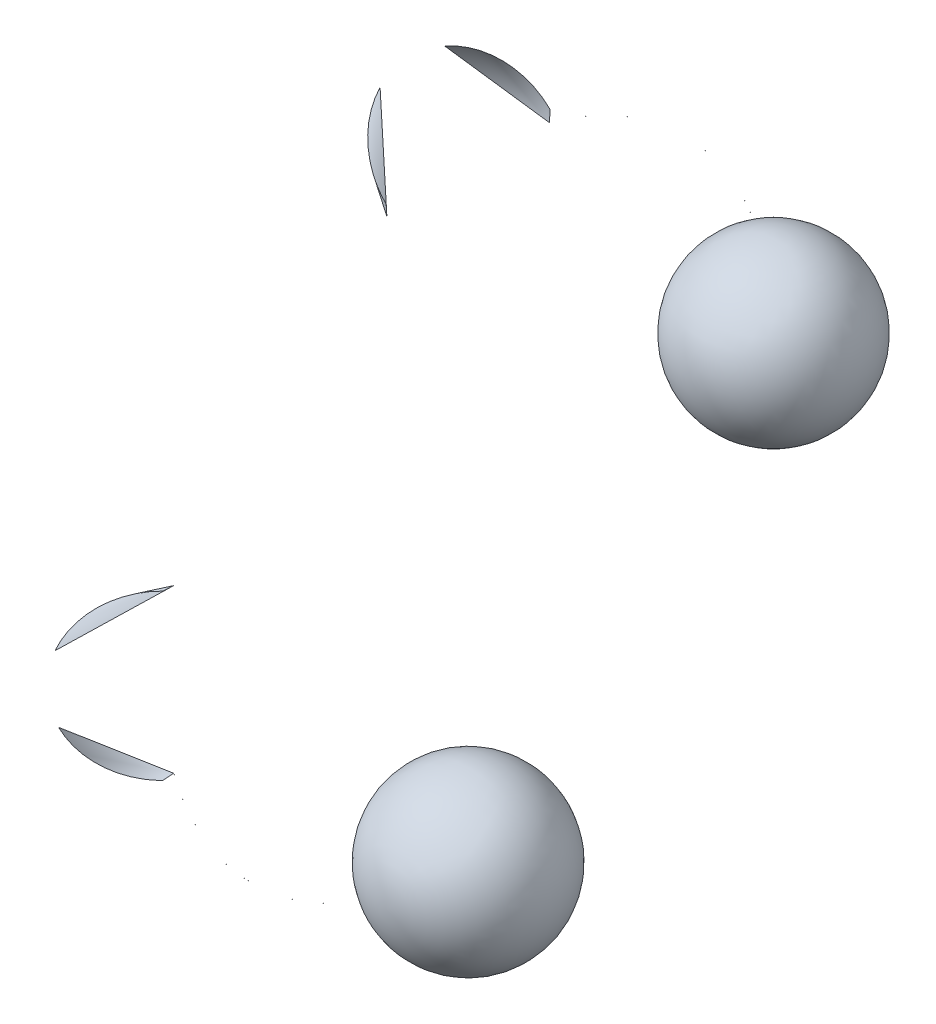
ISO-10303-21;
HEADER;
FILE_DESCRIPTION(('STEP AP214'),'2;1');
FILE_NAME('part.step','',(''),(''),'','','');
FILE_SCHEMA(('AUTOMOTIVE_DESIGN { 1 0 10303 214 1 1 1 1 }'));
ENDSEC;
DATA;
#1=APPLICATION_CONTEXT('core data for automotive mechanical design processes');
#2=APPLICATION_PROTOCOL_DEFINITION('international standard','automotive_design',2000,#1);
#3=PRODUCT_CONTEXT('',#1,'mechanical');
#4=PRODUCT('Part','Part','',(#3));
#5=PRODUCT_RELATED_PRODUCT_CATEGORY('part','',(#4));
#6=PRODUCT_DEFINITION_FORMATION('','',#4);
#7=PRODUCT_DEFINITION_CONTEXT('part definition',#1,'design');
#8=PRODUCT_DEFINITION('design','',#6,#7);
#9=PRODUCT_DEFINITION_SHAPE('','',#8);
#10=(LENGTH_UNIT() NAMED_UNIT(*) SI_UNIT(.MILLI.,.METRE.));
#11=(NAMED_UNIT(*) PLANE_ANGLE_UNIT() SI_UNIT($,.RADIAN.));
#12=(NAMED_UNIT(*) SI_UNIT($,.STERADIAN.) SOLID_ANGLE_UNIT());
#13=UNCERTAINTY_MEASURE_WITH_UNIT(LENGTH_MEASURE(1.E-05),#10,'distance_accuracy_value','');
#14=(GEOMETRIC_REPRESENTATION_CONTEXT(3) GLOBAL_UNCERTAINTY_ASSIGNED_CONTEXT((#13)) GLOBAL_UNIT_ASSIGNED_CONTEXT((#10,
#11,#12)) REPRESENTATION_CONTEXT('',''));
#15=CARTESIAN_POINT('',(0.,0.,0.));
#16=DIRECTION('',(0.,0.,1.));
#17=DIRECTION('',(1.,0.,0.));
#18=AXIS2_PLACEMENT_3D('',#15,#16,#17);
#19=CARTESIAN_POINT('',(6.,0.,0.));
#20=DIRECTION('',(1.,0.,0.));
#21=DIRECTION('',(0.,-1.,0.));
#22=AXIS2_PLACEMENT_3D('',#19,#20,#21);
#23=TOROIDAL_SURFACE('',#22,14.275,0.0001);
#24=CARTESIAN_POINT('',(5.99996532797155,-3.79863575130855,-13.7604022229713));
#25=CARTESIAN_POINT('',(5.99996006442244,-3.79863548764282,-13.7604002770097));
#26=CARTESIAN_POINT('',(5.99995496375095,-3.79863516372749,-13.7603978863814));
#27=CARTESIAN_POINT('',(5.99994523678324,-3.79863440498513,-13.7603922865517));
#28=CARTESIAN_POINT('',(5.99994061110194,-3.79863397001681,-13.7603890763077));
#29=CARTESIAN_POINT('',(5.99993197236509,-3.79863300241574,-13.7603819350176));
#30=CARTESIAN_POINT('',(5.99992795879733,-3.79863246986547,-13.7603780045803));
#31=CARTESIAN_POINT('',(5.99992064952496,-3.79863132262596,-13.760369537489));
#32=CARTESIAN_POINT('',(5.9999173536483,-3.79863070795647,-13.7603650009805));
#33=CARTESIAN_POINT('',(5.99991154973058,-3.79862940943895,-13.7603554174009));
#34=CARTESIAN_POINT('',(5.99990904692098,-3.79862872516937,-13.7603503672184));
#35=CARTESIAN_POINT('',(5.99990492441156,-3.79862731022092,-13.7603399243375));
#36=CARTESIAN_POINT('',(5.99990330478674,-3.79862657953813,-13.7603345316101));
#37=CARTESIAN_POINT('',(5.99990098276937,-3.79862508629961,-13.7603235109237));
#38=CARTESIAN_POINT('',(5.99990028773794,-3.79862432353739,-13.7603178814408));
#39=CARTESIAN_POINT('',(5.99989985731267,-3.79862279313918,-13.7603065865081));
#40=CARTESIAN_POINT('',(5.99990012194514,-3.79862202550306,-13.7603009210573));
#41=CARTESIAN_POINT('',(5.99990160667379,-3.79862050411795,-13.7602896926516));
#42=CARTESIAN_POINT('',(5.99990283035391,-3.79861975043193,-13.7602841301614));
#43=CARTESIAN_POINT('',(5.99990620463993,-3.79861828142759,-13.7602732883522));
#44=CARTESIAN_POINT('',(5.99990835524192,-3.79861756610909,-13.760268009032));
#45=CARTESIAN_POINT('',(5.99991351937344,-3.79861619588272,-13.7602578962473));
#46=CARTESIAN_POINT('',(5.9999165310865,-3.79861554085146,-13.7602530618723));
#47=CARTESIAN_POINT('',(5.99992333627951,-3.79861430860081,-13.7602439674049));
#48=CARTESIAN_POINT('',(5.99992712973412,-3.79861373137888,-13.7602397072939));
#49=CARTESIAN_POINT('',(5.99993536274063,-3.79861267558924,-13.7602319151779));
#50=CARTESIAN_POINT('',(5.99993979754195,-3.79861219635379,-13.7602283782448));
#51=CARTESIAN_POINT('',(5.99994920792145,-3.79861134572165,-13.7602221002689));
#52=CARTESIAN_POINT('',(5.9999541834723,-3.7986109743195,-13.760219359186));
#53=CARTESIAN_POINT('',(5.99996448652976,-3.79861035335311,-13.7602147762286));
#54=CARTESIAN_POINT('',(5.99996981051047,-3.7986101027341,-13.7602129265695));
#55=CARTESIAN_POINT('',(5.9999806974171,-3.79860972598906,-13.7602101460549));
#56=CARTESIAN_POINT('',(5.99998626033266,-3.79860959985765,-13.7602092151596));
#57=CARTESIAN_POINT('',(5.99999742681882,-3.79860947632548,-13.7602083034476));
#58=CARTESIAN_POINT('',(6.00000302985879,-3.79860947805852,-13.760208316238));
#59=CARTESIAN_POINT('',(6.00001415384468,-3.79860960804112,-13.7602092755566));
#60=CARTESIAN_POINT('',(6.00001967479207,-3.79860973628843,-13.760210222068));
#61=CARTESIAN_POINT('',(6.00003046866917,-3.79861011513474,-13.7602130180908));
#62=CARTESIAN_POINT('',(6.00003574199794,-3.79861036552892,-13.7602148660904));
#63=CARTESIAN_POINT('',(6.00004590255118,-3.79861098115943,-13.7602194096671));
#64=CARTESIAN_POINT('',(6.00005078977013,-3.7986113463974,-13.7602221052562));
#65=CARTESIAN_POINT('',(6.00006006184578,-3.79861218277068,-13.7602282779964));
#66=CARTESIAN_POINT('',(6.00006444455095,-3.79861265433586,-13.7602317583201));
#67=CARTESIAN_POINT('',(6.00007256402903,-3.79861368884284,-13.7602393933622));
#68=CARTESIAN_POINT('',(6.00007630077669,-3.79861425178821,-13.760243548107));
#69=CARTESIAN_POINT('',(6.00008305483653,-3.79861545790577,-13.7602524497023));
#70=CARTESIAN_POINT('',(6.00008606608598,-3.79861610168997,-13.7602572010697));
#71=CARTESIAN_POINT('',(6.00009124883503,-3.79861744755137,-13.7602671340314));
#72=CARTESIAN_POINT('',(6.00009342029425,-3.79861814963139,-13.7602723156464));
#73=CARTESIAN_POINT('',(6.00009688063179,-3.7986195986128,-13.7602830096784));
#74=CARTESIAN_POINT('',(6.00009816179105,-3.79862034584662,-13.7602885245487));
#75=CARTESIAN_POINT('',(6.00009977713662,-3.79862185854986,-13.7602996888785));
#76=CARTESIAN_POINT('',(6.00010011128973,-3.79862262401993,-13.7603053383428));
#77=CARTESIAN_POINT('',(6.00009982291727,-3.79862415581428,-13.760316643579));
#78=CARTESIAN_POINT('',(6.0000991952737,-3.79862492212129,-13.7603222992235));
#79=CARTESIAN_POINT('',(6.00009699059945,-3.79862642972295,-13.7603334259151));
#80=CARTESIAN_POINT('',(6.00009541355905,-3.79862717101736,-13.7603388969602));
#81=CARTESIAN_POINT('',(6.00009135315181,-3.79862860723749,-13.7603494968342));
#82=CARTESIAN_POINT('',(6.00008887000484,-3.79862930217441,-13.7603546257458));
#83=CARTESIAN_POINT('',(6.00008306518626,-3.79863062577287,-13.7603643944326));
#84=CARTESIAN_POINT('',(6.00007974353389,-3.79863125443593,-13.760369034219));
#85=CARTESIAN_POINT('',(6.00007237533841,-3.79863242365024,-13.7603776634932));
#86=CARTESIAN_POINT('',(6.0000683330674,-3.79863296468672,-13.7603816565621));
#87=CARTESIAN_POINT('',(6.00005962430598,-3.79863394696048,-13.7603889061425));
#88=CARTESIAN_POINT('',(6.0000549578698,-3.7986343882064,-13.7603921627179));
#89=CARTESIAN_POINT('',(6.00004517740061,-3.7986351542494,-13.7603978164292));
#90=CARTESIAN_POINT('',(6.00004006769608,-3.79863548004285,-13.7604002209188));
#91=CARTESIAN_POINT('',(6.00002950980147,-3.79863601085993,-13.7604041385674));
#92=CARTESIAN_POINT('',(6.00002406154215,-3.79863621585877,-13.7604056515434));
#93=CARTESIAN_POINT('',(6.00001302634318,-3.79863649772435,-13.7604077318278));
#94=CARTESIAN_POINT('',(6.0000074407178,-3.79863657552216,-13.7604083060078));
#95=CARTESIAN_POINT('',(5.99999625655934,-3.79863660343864,-13.760408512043));
#96=CARTESIAN_POINT('',(5.99999065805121,-3.79863655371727,-13.7604081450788));
#97=CARTESIAN_POINT('',(5.99998175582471,-3.7986363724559,-13.7604068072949));
#98=CARTESIAN_POINT('',(5.99997840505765,-3.7986362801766,-13.7604061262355));
#99=CARTESIAN_POINT('',(5.99997179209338,-3.79863604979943,-13.760404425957));
#100=CARTESIAN_POINT('',(5.99996852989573,-3.79863591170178,-13.7604034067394));
#101=CARTESIAN_POINT('',(5.99996532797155,-3.79863575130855,-13.7604022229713));
#102=B_SPLINE_CURVE_WITH_KNOTS('',3,(#24,#25,#26,#27,#28,#29,#30,#31,#32,#33,#34,#35,#36,#37,
#38,#39,#40,#41,#42,#43,#44,#45,#46,#47,#48,#49,#50,#51,#52,#53,#54,#55,#56,#57,#58,#59,#60,#61,
#62,#63,#64,#65,#66,#67,#68,#69,#70,#71,#72,#73,#74,#75,#76,#77,#78,#79,#80,#81,#82,#83,#84,#85,
#86,#87,#88,#89,#90,#91,#92,#93,#94,#95,#96,#97,#98,#99,#100,#101),.UNSPECIFIED.,.T.,.F.,(4,2,2,
2,2,2,2,2,2,2,2,2,2,2,2,2,2,2,2,2,2,2,2,2,2,2,2,2,2,2,2,2,2,2,2,2,2,2,4),(0.,
1.68412306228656E-05,3.3703996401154E-05,5.05525733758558E-05,6.73971071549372E-05,
8.43505480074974E-05,0.000101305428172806,0.000118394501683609,0.000135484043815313,
0.000152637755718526,0.000169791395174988,0.00018690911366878,0.000204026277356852,
0.000221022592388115,0.000238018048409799,0.000254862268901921,0.000271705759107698,
0.000288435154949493,0.000305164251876,0.000321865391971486,0.000338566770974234,
0.000355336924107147,0.000372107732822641,0.000389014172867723,0.000405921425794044,
0.00042297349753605,0.000440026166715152,0.000457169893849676,0.000474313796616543,
0.000491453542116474,0.000508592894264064,0.000525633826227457,0.000542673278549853,
0.000559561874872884,0.000576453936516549,0.00059322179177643,0.000609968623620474,
0.000620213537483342,0.000630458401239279),.UNSPECIFIED.);
#103=CARTESIAN_POINT('',(5.99996532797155,-3.79863575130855,-13.7604022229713));
#104=VERTEX_POINT('',#103);
#105=EDGE_CURVE('E10',#104,#104,#102,.T.);
#106=ORIENTED_EDGE('',*,*,#105,.F.);
#107=EDGE_LOOP('',(#106));
#108=FACE_BOUND('',#107,.T.);
#109=CARTESIAN_POINT('',(5.99996532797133,-13.7604022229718,-3.79863575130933));
#110=CARTESIAN_POINT('',(5.99997054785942,-13.7604041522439,-3.7986360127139));
#111=CARTESIAN_POINT('',(5.99997593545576,-13.7604056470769,-3.79863621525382));
#112=CARTESIAN_POINT('',(5.99998689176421,-13.7604077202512,-3.79863649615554));
#113=CARTESIAN_POINT('',(5.99999246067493,-13.7604082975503,-3.79863657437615));
#114=CARTESIAN_POINT('',(6.00000361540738,-13.7604085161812,-3.79863660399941));
#115=CARTESIAN_POINT('',(6.00000920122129,-13.7604081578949,-3.7986365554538));
#116=CARTESIAN_POINT('',(6.00002023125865,-13.7604065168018,-3.79863633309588));
#117=CARTESIAN_POINT('',(6.00002567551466,-13.7604052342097,-3.79863615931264));
#118=CARTESIAN_POINT('',(6.00003626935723,-13.760401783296,-3.79863569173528));
#119=CARTESIAN_POINT('',(6.00004141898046,-13.760399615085,-3.79863539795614));
#120=CARTESIAN_POINT('',(6.00005128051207,-13.7603944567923,-3.79863469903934));
#121=CARTESIAN_POINT('',(6.00005599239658,-13.7603914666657,-3.79863429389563));
#122=CARTESIAN_POINT('',(6.00006487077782,-13.7603847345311,-3.7986333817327));
#123=CARTESIAN_POINT('',(6.00006903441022,-13.7603809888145,-3.798632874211));
#124=CARTESIAN_POINT('',(6.00007667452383,-13.7603728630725,-3.79863177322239));
#125=CARTESIAN_POINT('',(6.00008015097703,-13.7603684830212,-3.79863117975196));
#126=CARTESIAN_POINT('',(6.00008634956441,-13.7603591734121,-3.79862991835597));
#127=CARTESIAN_POINT('',(6.00008906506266,-13.7603542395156,-3.79862924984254));
#128=CARTESIAN_POINT('',(6.00009362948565,-13.7603439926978,-3.79862786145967));
#129=CARTESIAN_POINT('',(6.00009547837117,-13.7603386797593,-3.79862714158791));
#130=CARTESIAN_POINT('',(6.00009827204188,-13.7603277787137,-3.79862566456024));
#131=CARTESIAN_POINT('',(6.00009920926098,-13.7603221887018,-3.79862490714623));
#132=CARTESIAN_POINT('',(6.00010012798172,-13.7603109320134,-3.79862338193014));
#133=CARTESIAN_POINT('',(6.00010010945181,-13.7603052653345,-3.79862261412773));
#134=CARTESIAN_POINT('',(6.00009911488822,-13.7602939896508,-3.79862108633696));
#135=CARTESIAN_POINT('',(6.00009813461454,-13.7602883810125,-3.79862032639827));
#136=CARTESIAN_POINT('',(6.00009523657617,-13.760277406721,-3.79861883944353));
#137=CARTESIAN_POINT('',(6.0000933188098,-13.760272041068,-3.79861811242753));
#138=CARTESIAN_POINT('',(6.00008860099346,-13.7602617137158,-3.79861671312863));
#139=CARTESIAN_POINT('',(6.00008580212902,-13.760256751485,-3.7986160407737));
#140=CARTESIAN_POINT('',(6.00007939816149,-13.7602473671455,-3.79861476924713));
#141=CARTESIAN_POINT('',(6.00007579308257,-13.7602429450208,-3.7986141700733));
#142=CARTESIAN_POINT('',(6.00006790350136,-13.7602347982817,-3.79861306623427));
#143=CARTESIAN_POINT('',(6.00006362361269,-13.7602310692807,-3.79861256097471));
#144=CARTESIAN_POINT('',(6.00005448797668,-13.7602243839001,-3.79861165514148));
#145=CARTESIAN_POINT('',(6.00004963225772,-13.7602214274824,-3.79861125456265));
#146=CARTESIAN_POINT('',(6.00003952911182,-13.7602163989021,-3.79861057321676));
#147=CARTESIAN_POINT('',(6.0000342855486,-13.7602143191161,-3.79861029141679));
#148=CARTESIAN_POINT('',(6.0000235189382,-13.7602110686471,-3.79860985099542));
#149=CARTESIAN_POINT('',(6.00001799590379,-13.7602098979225,-3.79860969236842));
#150=CARTESIAN_POINT('',(6.00000687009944,-13.760208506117,-3.79860950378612));
#151=CARTESIAN_POINT('',(6.00000126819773,-13.7602082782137,-3.79860947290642));
#152=CARTESIAN_POINT('',(5.99999010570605,-13.7602087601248,-3.79860953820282));
#153=CARTESIAN_POINT('',(5.99998454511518,-13.7602094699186,-3.79860963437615));
#154=CARTESIAN_POINT('',(5.99997363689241,-13.7602118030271,-3.79860995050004));
#155=CARTESIAN_POINT('',(5.9999682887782,-13.7602134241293,-3.79861017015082));
#156=CARTESIAN_POINT('',(5.99995794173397,-13.7602175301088,-3.79861072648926));
#157=CARTESIAN_POINT('',(5.9999529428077,-13.7602200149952,-3.79861106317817));
#158=CARTESIAN_POINT('',(5.99994341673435,-13.7602257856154,-3.79861184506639));
#159=CARTESIAN_POINT('',(5.99993889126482,-13.7602290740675,-3.79861229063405));
#160=CARTESIAN_POINT('',(5.99993045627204,-13.760236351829,-3.79861327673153));
#161=CARTESIAN_POINT('',(5.99992654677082,-13.7602403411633,-3.79861381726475));
#162=CARTESIAN_POINT('',(5.9999194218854,-13.7602489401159,-3.79861498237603));
#163=CARTESIAN_POINT('',(5.99991621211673,-13.7602535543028,-3.79861560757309));
#164=CARTESIAN_POINT('',(5.999910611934,-13.760263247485,-3.79861692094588));
#165=CARTESIAN_POINT('',(5.99990822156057,-13.7602683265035,-3.79861760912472));
#166=CARTESIAN_POINT('',(5.99990430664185,-13.7602788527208,-3.7986190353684));
#167=CARTESIAN_POINT('',(5.99990278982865,-13.7602843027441,-3.79861977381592));
#168=CARTESIAN_POINT('',(5.99990069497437,-13.760295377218,-3.79862127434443));
#169=CARTESIAN_POINT('',(5.99990011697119,-13.7603010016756,-3.79862203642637));
#170=CARTESIAN_POINT('',(5.99989991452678,-13.7603123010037,-3.79862356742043));
#171=CARTESIAN_POINT('',(5.99990029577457,-13.760317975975,-3.79862433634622));
#172=CARTESIAN_POINT('',(5.99990201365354,-13.7603291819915,-3.79862585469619));
#173=CARTESIAN_POINT('',(5.99990335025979,-13.7603347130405,-3.79862660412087));
#174=CARTESIAN_POINT('',(5.99990694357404,-13.7603454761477,-3.79862806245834));
#175=CARTESIAN_POINT('',(5.99990920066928,-13.7603507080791,-3.79862877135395));
#176=CARTESIAN_POINT('',(5.99991457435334,-13.7603607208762,-3.79863012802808));
#177=CARTESIAN_POINT('',(5.99991769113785,-13.7603655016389,-3.79863077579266));
#178=CARTESIAN_POINT('',(5.99992468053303,-13.7603744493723,-3.79863198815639));
#179=CARTESIAN_POINT('',(5.99992854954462,-13.7603786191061,-3.79863255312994));
#180=CARTESIAN_POINT('',(5.99993694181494,-13.7603862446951,-3.7986335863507));
#181=CARTESIAN_POINT('',(5.99994146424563,-13.7603897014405,-3.79863405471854));
#182=CARTESIAN_POINT('',(5.99994924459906,-13.7603946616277,-3.79863472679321));
#183=CARTESIAN_POINT('',(5.99995234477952,-13.7603964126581,-3.79863496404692));
#184=CARTESIAN_POINT('',(5.99995871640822,-13.7603995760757,-3.79863539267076));
#185=CARTESIAN_POINT('',(5.99996198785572,-13.7604009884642,-3.7986355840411));
#186=CARTESIAN_POINT('',(5.99996532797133,-13.7604022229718,-3.79863575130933));
#187=B_SPLINE_CURVE_WITH_KNOTS('',3,(#109,#110,#111,#112,#113,#114,#115,#116,#117,#118,#119,
#120,#121,#122,#123,#124,#125,#126,#127,#128,#129,#130,#131,#132,#133,#134,#135,#136,#137,#138,
#139,#140,#141,#142,#143,#144,#145,#146,#147,#148,#149,#150,#151,#152,#153,#154,#155,#156,#157,
#158,#159,#160,#161,#162,#163,#164,#165,#166,#167,#168,#169,#170,#171,#172,#173,#174,#175,#176,
#177,#178,#179,#180,#181,#182,#183,#184,#185,#186),.UNSPECIFIED.,.T.,.F.,(4,2,2,2,2,2,2,2,2,2,2,
2,2,2,2,2,2,2,2,2,2,2,2,2,2,2,2,2,2,2,2,2,2,2,2,2,2,2,4),(0.,1.6700465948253E-05,
3.34198844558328E-05,5.01324789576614E-05,6.68411947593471E-05,8.3547826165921E-05,
0.000100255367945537,0.000117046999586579,0.000133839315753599,0.000150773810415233,
0.000167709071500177,0.000184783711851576,0.000201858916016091,0.000219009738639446,
0.0002361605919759,0.000253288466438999,0.000270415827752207,0.000287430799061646,
0.000304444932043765,0.000321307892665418,0.000338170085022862,0.000354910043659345,
0.000371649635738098,0.000388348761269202,0.000405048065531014,0.000421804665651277,
0.000438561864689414,0.00045544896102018,0.00047233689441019,0.000489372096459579,
0.000506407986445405,0.000523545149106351,0.000540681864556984,0.000557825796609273,
0.000574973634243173,0.000592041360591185,0.000609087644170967,0.000619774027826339,
0.000630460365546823),.UNSPECIFIED.);
#188=CARTESIAN_POINT('',(5.99996532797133,-13.7604022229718,-3.79863575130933));
#189=VERTEX_POINT('',#188);
#190=EDGE_CURVE('E30',#189,#189,#187,.T.);
#191=ORIENTED_EDGE('',*,*,#190,.F.);
#192=EDGE_LOOP('',(#191));
#193=FACE_BOUND('',#192,.T.);
#194=ADVANCED_FACE('F14',(#108,#193),#23,.T.);
#195=CARTESIAN_POINT('',(5.99996532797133,3.79863575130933,-13.7604022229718));
#196=CARTESIAN_POINT('',(5.99997054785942,3.79863601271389,-13.7604041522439));
#197=CARTESIAN_POINT('',(5.99997593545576,3.79863621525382,-13.7604056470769));
#198=CARTESIAN_POINT('',(5.99998689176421,3.79863649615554,-13.7604077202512));
#199=CARTESIAN_POINT('',(5.99999246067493,3.79863657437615,-13.7604082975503));
#200=CARTESIAN_POINT('',(6.00000361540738,3.79863660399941,-13.7604085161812));
#201=CARTESIAN_POINT('',(6.00000920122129,3.7986365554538,-13.7604081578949));
#202=CARTESIAN_POINT('',(6.00002023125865,3.79863633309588,-13.7604065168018));
#203=CARTESIAN_POINT('',(6.00002567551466,3.79863615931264,-13.7604052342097));
#204=CARTESIAN_POINT('',(6.00003626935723,3.79863569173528,-13.760401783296));
#205=CARTESIAN_POINT('',(6.00004141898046,3.79863539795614,-13.760399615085));
#206=CARTESIAN_POINT('',(6.00005128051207,3.79863469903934,-13.7603944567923));
#207=CARTESIAN_POINT('',(6.00005599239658,3.79863429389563,-13.7603914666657));
#208=CARTESIAN_POINT('',(6.00006487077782,3.7986333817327,-13.7603847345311));
#209=CARTESIAN_POINT('',(6.00006903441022,3.798632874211,-13.7603809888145));
#210=CARTESIAN_POINT('',(6.00007667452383,3.79863177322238,-13.7603728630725));
#211=CARTESIAN_POINT('',(6.00008015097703,3.79863117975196,-13.7603684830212));
#212=CARTESIAN_POINT('',(6.00008634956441,3.79862991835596,-13.7603591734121));
#213=CARTESIAN_POINT('',(6.00008906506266,3.79862924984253,-13.7603542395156));
#214=CARTESIAN_POINT('',(6.00009362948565,3.79862786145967,-13.7603439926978));
#215=CARTESIAN_POINT('',(6.00009547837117,3.79862714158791,-13.7603386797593));
#216=CARTESIAN_POINT('',(6.00009827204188,3.79862566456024,-13.7603277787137));
#217=CARTESIAN_POINT('',(6.00009920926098,3.79862490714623,-13.7603221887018));
#218=CARTESIAN_POINT('',(6.00010012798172,3.79862338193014,-13.7603109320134));
#219=CARTESIAN_POINT('',(6.00010010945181,3.79862261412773,-13.7603052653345));
#220=CARTESIAN_POINT('',(6.00009911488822,3.79862108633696,-13.7602939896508));
#221=CARTESIAN_POINT('',(6.00009813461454,3.79862032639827,-13.7602883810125));
#222=CARTESIAN_POINT('',(6.00009523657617,3.79861883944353,-13.760277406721));
#223=CARTESIAN_POINT('',(6.0000933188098,3.79861811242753,-13.760272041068));
#224=CARTESIAN_POINT('',(6.00008860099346,3.79861671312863,-13.7602617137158));
#225=CARTESIAN_POINT('',(6.00008580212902,3.7986160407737,-13.760256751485));
#226=CARTESIAN_POINT('',(6.00007939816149,3.79861476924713,-13.7602473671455));
#227=CARTESIAN_POINT('',(6.00007579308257,3.7986141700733,-13.7602429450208));
#228=CARTESIAN_POINT('',(6.00006790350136,3.79861306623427,-13.7602347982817));
#229=CARTESIAN_POINT('',(6.00006362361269,3.79861256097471,-13.7602310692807));
#230=CARTESIAN_POINT('',(6.00005448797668,3.79861165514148,-13.7602243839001));
#231=CARTESIAN_POINT('',(6.00004963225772,3.79861125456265,-13.7602214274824));
#232=CARTESIAN_POINT('',(6.00003952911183,3.79861057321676,-13.760216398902));
#233=CARTESIAN_POINT('',(6.0000342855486,3.79861029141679,-13.7602143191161));
#234=CARTESIAN_POINT('',(6.00002351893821,3.79860985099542,-13.7602110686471));
#235=CARTESIAN_POINT('',(6.00001799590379,3.79860969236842,-13.7602098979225));
#236=CARTESIAN_POINT('',(6.00000687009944,3.79860950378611,-13.7602085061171));
#237=CARTESIAN_POINT('',(6.00000126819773,3.79860947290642,-13.7602082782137));
#238=CARTESIAN_POINT('',(5.99999010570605,3.79860953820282,-13.7602087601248));
#239=CARTESIAN_POINT('',(5.99998454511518,3.79860963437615,-13.7602094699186));
#240=CARTESIAN_POINT('',(5.99997363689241,3.79860995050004,-13.7602118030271));
#241=CARTESIAN_POINT('',(5.9999682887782,3.79861017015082,-13.7602134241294));
#242=CARTESIAN_POINT('',(5.99995794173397,3.79861072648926,-13.7602175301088));
#243=CARTESIAN_POINT('',(5.9999529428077,3.79861106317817,-13.7602200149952));
#244=CARTESIAN_POINT('',(5.99994341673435,3.79861184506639,-13.7602257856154));
#245=CARTESIAN_POINT('',(5.99993889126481,3.79861229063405,-13.7602290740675));
#246=CARTESIAN_POINT('',(5.99993045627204,3.79861327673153,-13.760236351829));
#247=CARTESIAN_POINT('',(5.99992654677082,3.79861381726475,-13.7602403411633));
#248=CARTESIAN_POINT('',(5.9999194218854,3.79861498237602,-13.7602489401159));
#249=CARTESIAN_POINT('',(5.99991621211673,3.79861560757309,-13.7602535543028));
#250=CARTESIAN_POINT('',(5.999910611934,3.79861692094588,-13.760263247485));
#251=CARTESIAN_POINT('',(5.99990822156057,3.79861760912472,-13.7602683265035));
#252=CARTESIAN_POINT('',(5.99990430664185,3.79861903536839,-13.7602788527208));
#253=CARTESIAN_POINT('',(5.99990278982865,3.79861977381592,-13.7602843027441));
#254=CARTESIAN_POINT('',(5.99990069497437,3.79862127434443,-13.760295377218));
#255=CARTESIAN_POINT('',(5.99990011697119,3.79862203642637,-13.7603010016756));
#256=CARTESIAN_POINT('',(5.99989991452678,3.79862356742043,-13.7603123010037));
#257=CARTESIAN_POINT('',(5.99990029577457,3.79862433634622,-13.760317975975));
#258=CARTESIAN_POINT('',(5.99990201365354,3.79862585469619,-13.7603291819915));
#259=CARTESIAN_POINT('',(5.99990335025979,3.79862660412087,-13.7603347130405));
#260=CARTESIAN_POINT('',(5.99990694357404,3.79862806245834,-13.7603454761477));
#261=CARTESIAN_POINT('',(5.99990920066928,3.79862877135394,-13.7603507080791));
#262=CARTESIAN_POINT('',(5.99991457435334,3.79863012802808,-13.7603607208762));
#263=CARTESIAN_POINT('',(5.99991769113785,3.79863077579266,-13.7603655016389));
#264=CARTESIAN_POINT('',(5.99992468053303,3.79863198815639,-13.7603744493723));
#265=CARTESIAN_POINT('',(5.99992854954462,3.79863255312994,-13.7603786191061));
#266=CARTESIAN_POINT('',(5.99993694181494,3.7986335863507,-13.7603862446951));
#267=CARTESIAN_POINT('',(5.99994146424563,3.79863405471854,-13.7603897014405));
#268=CARTESIAN_POINT('',(5.99994924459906,3.79863472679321,-13.7603946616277));
#269=CARTESIAN_POINT('',(5.99995234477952,3.79863496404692,-13.7603964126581));
#270=CARTESIAN_POINT('',(5.99995871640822,3.79863539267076,-13.7603995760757));
#271=CARTESIAN_POINT('',(5.99996198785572,3.7986355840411,-13.7604009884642));
#272=CARTESIAN_POINT('',(5.99996532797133,3.79863575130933,-13.7604022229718));
#273=B_SPLINE_CURVE_WITH_KNOTS('',3,(#195,#196,#197,#198,#199,#200,#201,#202,#203,#204,#205,
#206,#207,#208,#209,#210,#211,#212,#213,#214,#215,#216,#217,#218,#219,#220,#221,#222,#223,#224,
#225,#226,#227,#228,#229,#230,#231,#232,#233,#234,#235,#236,#237,#238,#239,#240,#241,#242,#243,
#244,#245,#246,#247,#248,#249,#250,#251,#252,#253,#254,#255,#256,#257,#258,#259,#260,#261,#262,
#263,#264,#265,#266,#267,#268,#269,#270,#271,#272),.UNSPECIFIED.,.T.,.F.,(4,2,2,2,2,2,2,2,2,2,2,
2,2,2,2,2,2,2,2,2,2,2,2,2,2,2,2,2,2,2,2,2,2,2,2,2,2,2,4),(0.,1.67004659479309E-05,
3.34198844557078E-05,5.01324789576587E-05,6.68411947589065E-05,8.35478261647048E-05,
0.00010025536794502,0.000117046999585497,0.000133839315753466,0.00015077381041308,
0.000167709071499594,0.000184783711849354,0.00020185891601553,0.000219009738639,
0.000236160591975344,0.000253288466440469,0.000270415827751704,0.000287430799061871,
0.00030444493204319,0.000321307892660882,0.00033817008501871,0.000354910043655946,
0.000371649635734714,0.000388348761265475,0.000405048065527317,0.000421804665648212,
0.000438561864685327,0.000455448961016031,0.000472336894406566,0.000489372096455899,
0.000506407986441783,0.000523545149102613,0.000540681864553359,0.000557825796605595,
0.000574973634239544,0.00059204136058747,0.000609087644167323,0.000619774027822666,
0.000630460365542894),.UNSPECIFIED.);
#274=CARTESIAN_POINT('',(5.99996532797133,3.79863575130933,-13.7604022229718));
#275=VERTEX_POINT('',#274);
#276=EDGE_CURVE('E26',#275,#275,#273,.T.);
#277=ORIENTED_EDGE('',*,*,#276,.F.);
#278=EDGE_LOOP('',(#277));
#279=FACE_BOUND('',#278,.T.);
#280=CARTESIAN_POINT('',(5.99996966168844,13.760213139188,-3.79861013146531));
#281=CARTESIAN_POINT('',(5.99997496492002,13.7602114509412,-3.79860990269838));
#282=CARTESIAN_POINT('',(5.99998041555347,13.7602102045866,-3.79860973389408));
#283=CARTESIAN_POINT('',(5.99999145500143,13.7602086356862,-3.79860952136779));
#284=CARTESIAN_POINT('',(5.99999704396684,13.7602083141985,-3.79860947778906));
#285=CARTESIAN_POINT('',(6.00000819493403,13.7602086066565,-3.7986095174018));
#286=CARTESIAN_POINT('',(6.00001375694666,13.7602092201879,-3.79860960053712));
#287=CARTESIAN_POINT('',(6.00002469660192,13.7602113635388,-3.79860989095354));
#288=CARTESIAN_POINT('',(6.00003007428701,13.7602128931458,-3.79861009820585));
#289=CARTESIAN_POINT('',(6.00004049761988,13.7602168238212,-3.79861063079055));
#290=CARTESIAN_POINT('',(6.00004554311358,13.7602192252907,-3.79861095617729));
#291=CARTESIAN_POINT('',(6.00005515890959,13.7602248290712,-3.79861171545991));
#292=CARTESIAN_POINT('',(6.00005972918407,13.760228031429,-3.79861214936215));
#293=CARTESIAN_POINT('',(6.000068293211,13.7602351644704,-3.79861311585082));
#294=CARTESIAN_POINT('',(6.00007228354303,13.7602390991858,-3.79861364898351));
#295=CARTESIAN_POINT('',(6.00007954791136,13.7602475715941,-3.7986147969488));
#296=CARTESIAN_POINT('',(6.00008282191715,13.7602521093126,-3.79861541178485));
#297=CARTESIAN_POINT('',(6.00008859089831,13.7602617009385,-3.79861671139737));
#298=CARTESIAN_POINT('',(6.00009107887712,13.7602667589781,-3.79861739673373));
#299=CARTESIAN_POINT('',(6.00009517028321,13.7602772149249,-3.79861881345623));
#300=CARTESIAN_POINT('',(6.00009677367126,13.7602826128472,-3.7986195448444));
#301=CARTESIAN_POINT('',(6.00009906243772,13.7602936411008,-3.79862103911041));
#302=CARTESIAN_POINT('',(6.0000997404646,13.7602992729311,-3.79862180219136));
#303=CARTESIAN_POINT('',(6.00010013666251,13.7603105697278,-3.79862333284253));
#304=CARTESIAN_POINT('',(6.00009985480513,13.7603162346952,-3.79862410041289));
#305=CARTESIAN_POINT('',(6.00009833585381,13.7603274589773,-3.79862562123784));
#306=CARTESIAN_POINT('',(6.00009709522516,13.760333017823,-3.79862637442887));
#307=CARTESIAN_POINT('',(6.00009368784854,13.7603438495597,-3.79862784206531));
#308=CARTESIAN_POINT('',(6.0000915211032,13.7603491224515,-3.79862855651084));
#309=CARTESIAN_POINT('',(6.00008632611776,13.7603592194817,-3.79862992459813));
#310=CARTESIAN_POINT('',(6.0000832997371,13.7603640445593,-3.79863057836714));
#311=CARTESIAN_POINT('',(6.00007646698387,13.7603731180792,-3.79863180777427));
#312=CARTESIAN_POINT('',(6.00007266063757,13.760377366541,-3.79863238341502));
#313=CARTESIAN_POINT('',(6.00006440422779,13.7603851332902,-3.79863343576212));
#314=CARTESIAN_POINT('',(6.00005995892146,13.7603886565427,-3.79863391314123));
#315=CARTESIAN_POINT('',(6.00005053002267,13.7603949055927,-3.79863475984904));
#316=CARTESIAN_POINT('',(6.00004554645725,13.7603976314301,-3.79863512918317));
#317=CARTESIAN_POINT('',(6.00003523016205,13.7604021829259,-3.79863574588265));
#318=CARTESIAN_POINT('',(6.00002990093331,13.7604040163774,-3.79863599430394));
#319=CARTESIAN_POINT('',(6.00001900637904,13.7604067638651,-3.79863636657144));
#320=CARTESIAN_POINT('',(6.00001344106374,13.7604076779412,-3.79863649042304));
#321=CARTESIAN_POINT('',(6.00000227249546,13.760408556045,-3.79863660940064));
#322=CARTESIAN_POINT('',(5.99999666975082,13.7604085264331,-3.79863660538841));
#323=CARTESIAN_POINT('',(5.99998554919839,13.7604075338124,-3.79863647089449));
#324=CARTESIAN_POINT('',(5.99998003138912,13.7604065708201,-3.79863634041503));
#325=CARTESIAN_POINT('',(5.99996924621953,13.7604037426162,-3.798635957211));
#326=CARTESIAN_POINT('',(5.9999639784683,13.7604018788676,-3.79863570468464));
#327=CARTESIAN_POINT('',(5.99995383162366,13.7603973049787,-3.79863508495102));
#328=CARTESIAN_POINT('',(5.99994895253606,13.7603945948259,-3.79863471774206));
#329=CARTESIAN_POINT('',(5.99993969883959,13.7603883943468,-3.7986338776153));
#330=CARTESIAN_POINT('',(5.99993532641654,13.7603849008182,-3.79863340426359));
#331=CARTESIAN_POINT('',(5.99992722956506,13.7603772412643,-3.79863236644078));
#332=CARTESIAN_POINT('',(5.99992350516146,13.7603730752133,-3.79863180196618));
#333=CARTESIAN_POINT('',(5.99991677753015,13.7603641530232,-3.79863059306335));
#334=CARTESIAN_POINT('',(5.99991378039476,13.7603593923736,-3.79862994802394));
#335=CARTESIAN_POINT('',(5.99990862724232,13.7603494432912,-3.79862859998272));
#336=CARTESIAN_POINT('',(5.99990647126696,13.7603442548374,-3.79862789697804));
#337=CARTESIAN_POINT('',(5.99990304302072,13.7603335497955,-3.79862644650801));
#338=CARTESIAN_POINT('',(5.99990177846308,13.760328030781,-3.7986256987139));
#339=CARTESIAN_POINT('',(5.99990019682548,13.7603168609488,-3.79862418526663));
#340=CARTESIAN_POINT('',(5.99989987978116,13.760311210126,-3.7986234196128));
#341=CARTESIAN_POINT('',(5.99990020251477,13.7602999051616,-3.79862188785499));
#342=CARTESIAN_POINT('',(5.99990084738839,13.7602942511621,-3.79862112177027));
#343=CARTESIAN_POINT('',(5.99990308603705,13.7602831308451,-3.79861961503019));
#344=CARTESIAN_POINT('',(5.99990467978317,13.7602776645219,-3.79861887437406));
#345=CARTESIAN_POINT('',(5.99990877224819,13.7602670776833,-3.79861743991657));
#346=CARTESIAN_POINT('',(5.99991127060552,13.7602619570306,-3.79861674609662));
#347=CARTESIAN_POINT('',(5.99991710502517,13.7602522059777,-3.79861542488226));
#348=CARTESIAN_POINT('',(5.9999204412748,13.7602475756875,-3.79861479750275));
#349=CARTESIAN_POINT('',(5.99992783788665,13.7602389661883,-3.79861363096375));
#350=CARTESIAN_POINT('',(5.99993189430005,13.7602349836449,-3.79861309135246));
#351=CARTESIAN_POINT('',(5.99994062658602,13.7602277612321,-3.79861211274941));
#352=CARTESIAN_POINT('',(5.99994530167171,13.7602245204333,-3.79861167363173));
#353=CARTESIAN_POINT('',(5.99995329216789,13.7602199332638,-3.79861105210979));
#354=CARTESIAN_POINT('',(5.99995646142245,13.7602183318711,-3.79861083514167));
#355=CARTESIAN_POINT('',(5.99996295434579,13.7602154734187,-3.7986104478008));
#356=CARTESIAN_POINT('',(5.99996627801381,13.7602142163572,-3.7986102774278));
#357=CARTESIAN_POINT('',(5.99996966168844,13.760213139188,-3.79861013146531));
#358=B_SPLINE_CURVE_WITH_KNOTS('',3,(#280,#281,#282,#283,#284,#285,#286,#287,#288,#289,#290,
#291,#292,#293,#294,#295,#296,#297,#298,#299,#300,#301,#302,#303,#304,#305,#306,#307,#308,#309,
#310,#311,#312,#313,#314,#315,#316,#317,#318,#319,#320,#321,#322,#323,#324,#325,#326,#327,#328,
#329,#330,#331,#332,#333,#334,#335,#336,#337,#338,#339,#340,#341,#342,#343,#344,#345,#346,#347,
#348,#349,#350,#351,#352,#353,#354,#355,#356,#357),.UNSPECIFIED.,.T.,.F.,(4,2,2,2,2,2,2,2,2,2,2,
2,2,2,2,2,2,2,2,2,2,2,2,2,2,2,2,2,2,2,2,2,2,2,2,2,2,2,4),(0.,1.66975699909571E-05,
3.34142349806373E-05,5.01234935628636E-05,6.68288767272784E-05,8.35419552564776E-05,
0.000100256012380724,0.000117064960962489,0.000133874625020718,0.000150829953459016,
0.000167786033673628,0.000184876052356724,0.000201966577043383,0.000219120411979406,
0.000236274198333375,0.000253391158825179,0.000270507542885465,0.000287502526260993,
0.000304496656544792,0.000321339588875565,0.00033818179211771,0.000354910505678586,
0.000371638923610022,0.000388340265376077,0.000405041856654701,0.000421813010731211,
0.000438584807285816,0.000455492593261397,0.000472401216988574,0.0004894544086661,
0.000506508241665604,0.000523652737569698,0.000540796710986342,0.000557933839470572,
0.000575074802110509,0.000592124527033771,0.0006091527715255,0.000619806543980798,
0.000630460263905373),.UNSPECIFIED.);
#359=CARTESIAN_POINT('',(5.99996966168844,13.760213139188,-3.79861013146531));
#360=VERTEX_POINT('',#359);
#361=EDGE_CURVE('E73',#360,#360,#358,.T.);
#362=ORIENTED_EDGE('',*,*,#361,.F.);
#363=EDGE_LOOP('',(#362));
#364=FACE_BOUND('',#363,.T.);
#365=ADVANCED_FACE('F98',(#279,#364),#23,.T.);
#366=CARTESIAN_POINT('',(5.99996532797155,-13.7604022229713,3.79863575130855));
#367=CARTESIAN_POINT('',(5.99996006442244,-13.7604002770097,3.79863548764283));
#368=CARTESIAN_POINT('',(5.99995496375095,-13.7603978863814,3.79863516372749));
#369=CARTESIAN_POINT('',(5.99994523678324,-13.7603922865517,3.79863440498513));
#370=CARTESIAN_POINT('',(5.99994061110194,-13.7603890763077,3.79863397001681));
#371=CARTESIAN_POINT('',(5.99993197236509,-13.7603819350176,3.79863300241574));
#372=CARTESIAN_POINT('',(5.99992795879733,-13.7603780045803,3.79863246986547));
#373=CARTESIAN_POINT('',(5.99992064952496,-13.760369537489,3.79863132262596));
#374=CARTESIAN_POINT('',(5.9999173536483,-13.7603650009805,3.79863070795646));
#375=CARTESIAN_POINT('',(5.99991154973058,-13.7603554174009,3.79862940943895));
#376=CARTESIAN_POINT('',(5.99990904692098,-13.7603503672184,3.79862872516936));
#377=CARTESIAN_POINT('',(5.99990492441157,-13.7603399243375,3.79862731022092));
#378=CARTESIAN_POINT('',(5.99990330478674,-13.7603345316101,3.79862657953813));
#379=CARTESIAN_POINT('',(5.99990098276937,-13.7603235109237,3.79862508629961));
#380=CARTESIAN_POINT('',(5.99990028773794,-13.7603178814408,3.79862432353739));
#381=CARTESIAN_POINT('',(5.99989985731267,-13.7603065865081,3.79862279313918));
#382=CARTESIAN_POINT('',(5.99990012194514,-13.7603009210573,3.79862202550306));
#383=CARTESIAN_POINT('',(5.99990160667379,-13.7602896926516,3.79862050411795));
#384=CARTESIAN_POINT('',(5.99990283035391,-13.7602841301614,3.79861975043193));
#385=CARTESIAN_POINT('',(5.99990620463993,-13.7602732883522,3.79861828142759));
#386=CARTESIAN_POINT('',(5.99990835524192,-13.760268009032,3.79861756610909));
#387=CARTESIAN_POINT('',(5.99991351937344,-13.7602578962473,3.79861619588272));
#388=CARTESIAN_POINT('',(5.9999165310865,-13.7602530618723,3.79861554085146));
#389=CARTESIAN_POINT('',(5.99992333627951,-13.7602439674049,3.7986143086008));
#390=CARTESIAN_POINT('',(5.99992712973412,-13.7602397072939,3.79861373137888));
#391=CARTESIAN_POINT('',(5.99993536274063,-13.7602319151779,3.79861267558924));
#392=CARTESIAN_POINT('',(5.99993979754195,-13.7602283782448,3.79861219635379));
#393=CARTESIAN_POINT('',(5.99994920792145,-13.7602221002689,3.79861134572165));
#394=CARTESIAN_POINT('',(5.9999541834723,-13.760219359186,3.7986109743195));
#395=CARTESIAN_POINT('',(5.99996448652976,-13.7602147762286,3.79861035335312));
#396=CARTESIAN_POINT('',(5.99996981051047,-13.7602129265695,3.7986101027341));
#397=CARTESIAN_POINT('',(5.99998069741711,-13.7602101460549,3.79860972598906));
#398=CARTESIAN_POINT('',(5.99998626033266,-13.7602092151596,3.79860959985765));
#399=CARTESIAN_POINT('',(5.99999742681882,-13.7602083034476,3.79860947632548));
#400=CARTESIAN_POINT('',(6.00000302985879,-13.760208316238,3.79860947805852));
#401=CARTESIAN_POINT('',(6.00001415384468,-13.7602092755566,3.79860960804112));
#402=CARTESIAN_POINT('',(6.00001967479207,-13.760210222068,3.79860973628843));
#403=CARTESIAN_POINT('',(6.00003046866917,-13.7602130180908,3.79861011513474));
#404=CARTESIAN_POINT('',(6.00003574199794,-13.7602148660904,3.79861036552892));
#405=CARTESIAN_POINT('',(6.00004590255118,-13.7602194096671,3.79861098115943));
#406=CARTESIAN_POINT('',(6.00005078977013,-13.7602221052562,3.7986113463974));
#407=CARTESIAN_POINT('',(6.00006006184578,-13.7602282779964,3.79861218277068));
#408=CARTESIAN_POINT('',(6.00006444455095,-13.7602317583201,3.79861265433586));
#409=CARTESIAN_POINT('',(6.00007256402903,-13.7602393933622,3.79861368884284));
#410=CARTESIAN_POINT('',(6.00007630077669,-13.760243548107,3.79861425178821));
#411=CARTESIAN_POINT('',(6.00008305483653,-13.7602524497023,3.79861545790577));
#412=CARTESIAN_POINT('',(6.00008606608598,-13.7602572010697,3.79861610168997));
#413=CARTESIAN_POINT('',(6.00009124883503,-13.7602671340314,3.79861744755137));
#414=CARTESIAN_POINT('',(6.00009342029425,-13.7602723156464,3.79861814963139));
#415=CARTESIAN_POINT('',(6.00009688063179,-13.7602830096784,3.7986195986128));
#416=CARTESIAN_POINT('',(6.00009816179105,-13.7602885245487,3.79862034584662));
#417=CARTESIAN_POINT('',(6.00009977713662,-13.7602996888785,3.79862185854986));
#418=CARTESIAN_POINT('',(6.00010011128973,-13.7603053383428,3.79862262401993));
#419=CARTESIAN_POINT('',(6.00009982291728,-13.760316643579,3.79862415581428));
#420=CARTESIAN_POINT('',(6.0000991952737,-13.7603222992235,3.79862492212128));
#421=CARTESIAN_POINT('',(6.00009699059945,-13.7603334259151,3.79862642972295));
#422=CARTESIAN_POINT('',(6.00009541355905,-13.7603388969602,3.79862717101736));
#423=CARTESIAN_POINT('',(6.00009135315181,-13.7603494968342,3.79862860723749));
#424=CARTESIAN_POINT('',(6.00008887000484,-13.7603546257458,3.79862930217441));
#425=CARTESIAN_POINT('',(6.00008306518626,-13.7603643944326,3.79863062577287));
#426=CARTESIAN_POINT('',(6.00007974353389,-13.760369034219,3.79863125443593));
#427=CARTESIAN_POINT('',(6.00007237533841,-13.7603776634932,3.79863242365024));
#428=CARTESIAN_POINT('',(6.0000683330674,-13.7603816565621,3.79863296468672));
#429=CARTESIAN_POINT('',(6.00005962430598,-13.7603889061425,3.79863394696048));
#430=CARTESIAN_POINT('',(6.0000549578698,-13.7603921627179,3.7986343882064));
#431=CARTESIAN_POINT('',(6.00004517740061,-13.7603978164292,3.7986351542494));
#432=CARTESIAN_POINT('',(6.00004006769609,-13.7604002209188,3.79863548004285));
#433=CARTESIAN_POINT('',(6.00002950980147,-13.7604041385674,3.79863601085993));
#434=CARTESIAN_POINT('',(6.00002406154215,-13.7604056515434,3.79863621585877));
#435=CARTESIAN_POINT('',(6.00001302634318,-13.7604077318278,3.79863649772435));
#436=CARTESIAN_POINT('',(6.00000744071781,-13.7604083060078,3.79863657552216));
#437=CARTESIAN_POINT('',(5.99999625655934,-13.760408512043,3.79863660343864));
#438=CARTESIAN_POINT('',(5.99999065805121,-13.7604081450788,3.79863655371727));
#439=CARTESIAN_POINT('',(5.99998175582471,-13.7604068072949,3.7986363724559));
#440=CARTESIAN_POINT('',(5.99997840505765,-13.7604061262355,3.7986362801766));
#441=CARTESIAN_POINT('',(5.99997179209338,-13.760404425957,3.79863604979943));
#442=CARTESIAN_POINT('',(5.99996852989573,-13.7604034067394,3.79863591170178));
#443=CARTESIAN_POINT('',(5.99996532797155,-13.7604022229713,3.79863575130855));
#444=B_SPLINE_CURVE_WITH_KNOTS('',3,(#366,#367,#368,#369,#370,#371,#372,#373,#374,#375,#376,
#377,#378,#379,#380,#381,#382,#383,#384,#385,#386,#387,#388,#389,#390,#391,#392,#393,#394,#395,
#396,#397,#398,#399,#400,#401,#402,#403,#404,#405,#406,#407,#408,#409,#410,#411,#412,#413,#414,
#415,#416,#417,#418,#419,#420,#421,#422,#423,#424,#425,#426,#427,#428,#429,#430,#431,#432,#433,
#434,#435,#436,#437,#438,#439,#440,#441,#442,#443),.UNSPECIFIED.,.T.,.F.,(4,2,2,2,2,2,2,2,2,2,2,
2,2,2,2,2,2,2,2,2,2,2,2,2,2,2,2,2,2,2,2,2,2,2,2,2,2,2,4),(0.,1.68412306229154E-05,
3.3703996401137E-05,5.05525733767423E-05,6.73971071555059E-05,8.43505480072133E-05,
0.000101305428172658,0.00011839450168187,0.000135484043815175,0.000152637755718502,
0.000169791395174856,0.000186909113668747,0.000204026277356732,0.000221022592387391,
0.000238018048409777,0.000254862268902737,0.000271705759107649,0.000288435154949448,
0.000305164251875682,0.000321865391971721,0.000338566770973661,0.000355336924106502,
0.000372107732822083,0.000389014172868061,0.000405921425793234,0.000422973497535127,
0.000440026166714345,0.000457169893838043,0.00047431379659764,0.000491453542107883,
0.000508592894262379,0.000525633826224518,0.000542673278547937,0.000559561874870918,
0.000576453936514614,0.000593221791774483,0.000609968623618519,0.000620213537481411,
0.000630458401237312),.UNSPECIFIED.);
#445=CARTESIAN_POINT('',(5.99996532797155,-13.7604022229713,3.79863575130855));
#446=VERTEX_POINT('',#445);
#447=EDGE_CURVE('E34',#446,#446,#444,.T.);
#448=ORIENTED_EDGE('',*,*,#447,.F.);
#449=EDGE_LOOP('',(#448));
#450=FACE_BOUND('',#449,.T.);
#451=CARTESIAN_POINT('',(5.99996966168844,-3.79861013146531,13.760213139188));
#452=CARTESIAN_POINT('',(5.99996431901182,-3.79861036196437,13.7602148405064));
#453=CARTESIAN_POINT('',(5.99995911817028,-3.79861065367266,13.7602169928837));
#454=CARTESIAN_POINT('',(5.99994915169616,-3.79861135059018,13.7602221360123));
#455=CARTESIAN_POINT('',(5.99994438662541,-3.79861175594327,13.7602251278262));
#456=CARTESIAN_POINT('',(5.99993543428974,-3.79861266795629,13.7602318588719));
#457=CARTESIAN_POINT('',(5.99993124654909,-3.79861317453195,13.760235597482));
#458=CARTESIAN_POINT('',(5.99992355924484,-3.79861427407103,13.7602437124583));
#459=CARTESIAN_POINT('',(5.99992005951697,-3.79861486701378,13.7602480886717));
#460=CARTESIAN_POINT('',(5.99991382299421,-3.79861612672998,13.7602573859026));
#461=CARTESIAN_POINT('',(5.9999110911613,-3.79861679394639,13.7602623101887));
#462=CARTESIAN_POINT('',(5.99990649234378,-3.79861818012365,13.7602725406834));
#463=CARTESIAN_POINT('',(5.99990462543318,-3.79861889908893,13.7602778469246));
#464=CARTESIAN_POINT('',(5.99990179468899,-3.79862037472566,13.7602887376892));
#465=CARTESIAN_POINT('',(5.99990083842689,-3.7986211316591,13.760294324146));
#466=CARTESIAN_POINT('',(5.99989988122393,-3.79862265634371,13.7603055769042));
#467=CARTESIAN_POINT('',(5.9998998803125,-3.79862342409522,13.7603112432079));
#468=CARTESIAN_POINT('',(5.99990083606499,-3.79862495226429,13.7603225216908));
#469=CARTESIAN_POINT('',(5.99990179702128,-3.79862571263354,13.7603281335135));
#470=CARTESIAN_POINT('',(5.9999046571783,-3.79862720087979,13.7603391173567));
#471=CARTESIAN_POINT('',(5.99990655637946,-3.79862792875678,13.7603444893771));
#472=CARTESIAN_POINT('',(5.99991123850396,-3.79862933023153,13.7603548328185));
#473=CARTESIAN_POINT('',(5.99991402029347,-3.79863000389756,13.7603598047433));
#474=CARTESIAN_POINT('',(5.99992039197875,-3.79863127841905,13.760369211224));
#475=CARTESIAN_POINT('',(5.99992398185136,-3.79863187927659,13.7603736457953));
#476=CARTESIAN_POINT('',(5.99993184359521,-3.79863298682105,13.7603818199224));
#477=CARTESIAN_POINT('',(5.99993611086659,-3.79863349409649,13.7603855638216));
#478=CARTESIAN_POINT('',(5.99994522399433,-3.79863440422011,13.7603922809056));
#479=CARTESIAN_POINT('',(5.99995006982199,-3.79863480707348,13.7603952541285));
#480=CARTESIAN_POINT('',(5.99996015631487,-3.7986354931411,13.7604003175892));
#481=CARTESIAN_POINT('',(5.99996539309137,-3.79863577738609,13.7604024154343));
#482=CARTESIAN_POINT('',(5.99997614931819,-3.79863622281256,13.7604057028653));
#483=CARTESIAN_POINT('',(5.99998166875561,-3.79863638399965,13.7604068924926));
#484=CARTESIAN_POINT('',(5.99999279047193,-3.79863657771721,13.7604083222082));
#485=CARTESIAN_POINT('',(5.99999839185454,-3.79863661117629,13.7604085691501));
#486=CARTESIAN_POINT('',(6.00000955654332,-3.79863655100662,13.760408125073));
#487=CARTESIAN_POINT('',(6.00001511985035,-3.79863645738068,13.7604074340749));
#488=CARTESIAN_POINT('',(6.00002603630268,-3.79863614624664,13.7604051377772));
#489=CARTESIAN_POINT('',(6.00003138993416,-3.79863592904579,13.7604035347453));
#490=CARTESIAN_POINT('',(6.00004175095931,-3.79863537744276,13.7603994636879));
#491=CARTESIAN_POINT('',(6.00004675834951,-3.7986350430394,13.7603969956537));
#492=CARTESIAN_POINT('',(6.00005630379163,-3.79863426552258,13.7603912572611));
#493=CARTESIAN_POINT('',(6.00006084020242,-3.79863382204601,13.7603879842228));
#494=CARTESIAN_POINT('',(6.00006929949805,-3.79863283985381,13.7603807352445));
#495=CARTESIAN_POINT('',(6.0000732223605,-3.79863230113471,13.7603767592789));
#496=CARTESIAN_POINT('',(6.00008037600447,-3.79863113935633,13.7603681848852));
#497=CARTESIAN_POINT('',(6.00008360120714,-3.79863051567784,13.7603635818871));
#498=CARTESIAN_POINT('',(6.0000892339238,-3.79862920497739,13.760353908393));
#499=CARTESIAN_POINT('',(6.00009164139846,-3.79862851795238,13.7603488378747));
#500=CARTESIAN_POINT('',(6.00009559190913,-3.79862709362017,13.7603383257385));
#501=CARTESIAN_POINT('',(6.00009712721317,-3.79862635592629,13.7603328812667));
#502=CARTESIAN_POINT('',(6.00009925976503,-3.79862485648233,13.7603218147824));
#503=CARTESIAN_POINT('',(6.00009985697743,-3.79862409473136,13.7603161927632));
#504=CARTESIAN_POINT('',(6.00010009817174,-3.79862256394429,13.7603048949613));
#505=CARTESIAN_POINT('',(6.00009973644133,-3.79862179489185,13.7602992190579));
#506=CARTESIAN_POINT('',(6.00009805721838,-3.79862027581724,13.7602880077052));
#507=CARTESIAN_POINT('',(6.00009673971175,-3.79861952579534,13.7602824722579));
#508=CARTESIAN_POINT('',(6.00009318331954,-3.79861806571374,13.7602716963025));
#509=CARTESIAN_POINT('',(6.00009094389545,-3.79861735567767,13.7602664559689));
#510=CARTESIAN_POINT('',(6.00008560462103,-3.79861599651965,13.7602564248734));
#511=CARTESIAN_POINT('',(6.0000825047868,-3.79861534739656,13.7602516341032));
#512=CARTESIAN_POINT('',(6.00007554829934,-3.79861413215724,13.7602426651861));
#513=CARTESIAN_POINT('',(6.00007169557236,-3.79861356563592,13.7602384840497));
#514=CARTESIAN_POINT('',(6.00006333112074,-3.79861252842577,13.7602308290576));
#515=CARTESIAN_POINT('',(6.00005881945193,-3.79861205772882,13.7602273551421));
#516=CARTESIAN_POINT('',(6.00004930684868,-3.79861122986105,13.7602212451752));
#517=CARTESIAN_POINT('',(6.00004431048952,-3.79861087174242,13.7602186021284));
#518=CARTESIAN_POINT('',(6.0000339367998,-3.79861027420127,13.7602141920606));
#519=CARTESIAN_POINT('',(6.00002855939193,-3.79861003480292,13.7602124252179));
#520=CARTESIAN_POINT('',(6.00001762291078,-3.79860968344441,13.760209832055));
#521=CARTESIAN_POINT('',(6.00001206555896,-3.79860957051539,13.7602089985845));
#522=CARTESIAN_POINT('',(6.00000089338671,-3.79860947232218,13.7602082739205));
#523=CARTESIAN_POINT('',(5.99999527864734,-3.79860948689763,13.7602083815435));
#524=CARTESIAN_POINT('',(5.99998631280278,-3.7986096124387,13.7602093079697));
#525=CARTESIAN_POINT('',(5.99998292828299,-3.79860968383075,13.760209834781));
#526=CARTESIAN_POINT('',(5.99997623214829,-3.79860987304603,13.760211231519));
#527=CARTESIAN_POINT('',(5.99997292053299,-3.79860999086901,13.7602121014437));
#528=CARTESIAN_POINT('',(5.99996966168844,-3.79861013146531,13.760213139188));
#529=B_SPLINE_CURVE_WITH_KNOTS('',3,(#451,#452,#453,#454,#455,#456,#457,#458,#459,#460,#461,
#462,#463,#464,#465,#466,#467,#468,#469,#470,#471,#472,#473,#474,#475,#476,#477,#478,#479,#480,
#481,#482,#483,#484,#485,#486,#487,#488,#489,#490,#491,#492,#493,#494,#495,#496,#497,#498,#499,
#500,#501,#502,#503,#504,#505,#506,#507,#508,#509,#510,#511,#512,#513,#514,#515,#516,#517,#518,
#519,#520,#521,#522,#523,#524,#525,#526,#527,#528),.UNSPECIFIED.,.T.,.F.,(4,2,2,2,2,2,2,2,2,2,2,
2,2,2,2,2,2,2,2,2,2,2,2,2,2,2,2,2,2,2,2,2,2,2,2,2,2,2,4),(0.,1.68226768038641E-05,
3.36667457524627E-05,5.04968506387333E-05,6.73229321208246E-05,8.42553637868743E-05,
0.000101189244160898,0.000118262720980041,0.000135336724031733,0.000152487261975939,
0.000169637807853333,0.000186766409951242,0.000203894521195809,0.000220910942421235,
0.000237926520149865,0.000254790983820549,0.000271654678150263,0.000288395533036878,
0.000305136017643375,0.000321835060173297,0.000338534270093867,0.000355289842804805,
0.000372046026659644,0.000388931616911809,0.000405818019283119,0.000422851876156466,
0.000439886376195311,0.000457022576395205,0.000474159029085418,0.000491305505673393,
0.000508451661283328,0.000525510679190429,0.000542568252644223,0.000559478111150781,
0.000576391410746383,0.000593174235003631,0.000609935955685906,0.000620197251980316,
0.000630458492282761),.UNSPECIFIED.);
#530=CARTESIAN_POINT('',(5.99996966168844,-3.79861013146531,13.760213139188));
#531=VERTEX_POINT('',#530);
#532=EDGE_CURVE('E61',#531,#531,#529,.T.);
#533=ORIENTED_EDGE('',*,*,#532,.F.);
#534=EDGE_LOOP('',(#533));
#535=FACE_BOUND('',#534,.T.);
#536=ADVANCED_FACE('F94',(#450,#535),#23,.T.);
#537=CARTESIAN_POINT('',(5.99996966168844,3.79861013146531,13.760213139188));
#538=CARTESIAN_POINT('',(5.99997496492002,3.79860990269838,13.7602114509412));
#539=CARTESIAN_POINT('',(5.99998041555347,3.79860973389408,13.7602102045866));
#540=CARTESIAN_POINT('',(5.99999145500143,3.79860952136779,13.7602086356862));
#541=CARTESIAN_POINT('',(5.99999704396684,3.79860947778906,13.7602083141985));
#542=CARTESIAN_POINT('',(6.00000819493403,3.7986095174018,13.7602086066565));
#543=CARTESIAN_POINT('',(6.00001375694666,3.79860960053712,13.7602092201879));
#544=CARTESIAN_POINT('',(6.00002469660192,3.79860989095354,13.7602113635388));
#545=CARTESIAN_POINT('',(6.00003007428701,3.79861009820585,13.7602128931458));
#546=CARTESIAN_POINT('',(6.00004049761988,3.79861063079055,13.7602168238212));
#547=CARTESIAN_POINT('',(6.00004554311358,3.79861095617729,13.7602192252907));
#548=CARTESIAN_POINT('',(6.0000551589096,3.79861171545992,13.7602248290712));
#549=CARTESIAN_POINT('',(6.00005972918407,3.79861214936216,13.760228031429));
#550=CARTESIAN_POINT('',(6.000068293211,3.79861311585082,13.7602351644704));
#551=CARTESIAN_POINT('',(6.00007228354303,3.79861364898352,13.7602390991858));
#552=CARTESIAN_POINT('',(6.00007954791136,3.7986147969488,13.7602475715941));
#553=CARTESIAN_POINT('',(6.00008282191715,3.79861541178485,13.7602521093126));
#554=CARTESIAN_POINT('',(6.00008859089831,3.79861671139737,13.7602617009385));
#555=CARTESIAN_POINT('',(6.00009107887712,3.79861739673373,13.7602667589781));
#556=CARTESIAN_POINT('',(6.00009517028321,3.79861881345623,13.7602772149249));
#557=CARTESIAN_POINT('',(6.00009677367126,3.7986195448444,13.7602826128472));
#558=CARTESIAN_POINT('',(6.00009906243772,3.79862103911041,13.7602936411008));
#559=CARTESIAN_POINT('',(6.0000997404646,3.79862180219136,13.7602992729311));
#560=CARTESIAN_POINT('',(6.00010013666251,3.79862333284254,13.7603105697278));
#561=CARTESIAN_POINT('',(6.00009985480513,3.79862410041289,13.7603162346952));
#562=CARTESIAN_POINT('',(6.00009833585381,3.79862562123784,13.7603274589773));
#563=CARTESIAN_POINT('',(6.00009709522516,3.79862637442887,13.760333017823));
#564=CARTESIAN_POINT('',(6.00009368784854,3.79862784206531,13.7603438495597));
#565=CARTESIAN_POINT('',(6.0000915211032,3.79862855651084,13.7603491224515));
#566=CARTESIAN_POINT('',(6.00008632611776,3.79862992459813,13.7603592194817));
#567=CARTESIAN_POINT('',(6.0000832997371,3.79863057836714,13.7603640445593));
#568=CARTESIAN_POINT('',(6.00007646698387,3.79863180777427,13.7603731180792));
#569=CARTESIAN_POINT('',(6.00007266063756,3.79863238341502,13.760377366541));
#570=CARTESIAN_POINT('',(6.00006440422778,3.79863343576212,13.7603851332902));
#571=CARTESIAN_POINT('',(6.00005995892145,3.79863391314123,13.7603886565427));
#572=CARTESIAN_POINT('',(6.00005053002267,3.79863475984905,13.7603949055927));
#573=CARTESIAN_POINT('',(6.00004554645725,3.79863512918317,13.7603976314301));
#574=CARTESIAN_POINT('',(6.00003523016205,3.79863574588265,13.7604021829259));
#575=CARTESIAN_POINT('',(6.00002990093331,3.79863599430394,13.7604040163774));
#576=CARTESIAN_POINT('',(6.00001900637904,3.79863636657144,13.7604067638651));
#577=CARTESIAN_POINT('',(6.00001344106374,3.79863649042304,13.7604076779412));
#578=CARTESIAN_POINT('',(6.00000227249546,3.79863660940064,13.760408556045));
#579=CARTESIAN_POINT('',(5.99999666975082,3.79863660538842,13.7604085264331));
#580=CARTESIAN_POINT('',(5.99998554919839,3.7986364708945,13.7604075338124));
#581=CARTESIAN_POINT('',(5.99998003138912,3.79863634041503,13.7604065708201));
#582=CARTESIAN_POINT('',(5.99996924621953,3.798635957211,13.7604037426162));
#583=CARTESIAN_POINT('',(5.9999639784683,3.79863570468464,13.7604018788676));
#584=CARTESIAN_POINT('',(5.99995383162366,3.79863508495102,13.7603973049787));
#585=CARTESIAN_POINT('',(5.99994895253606,3.79863471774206,13.7603945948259));
#586=CARTESIAN_POINT('',(5.99993969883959,3.7986338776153,13.7603883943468));
#587=CARTESIAN_POINT('',(5.99993532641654,3.7986334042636,13.7603849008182));
#588=CARTESIAN_POINT('',(5.99992722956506,3.79863236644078,13.7603772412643));
#589=CARTESIAN_POINT('',(5.99992350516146,3.79863180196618,13.7603730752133));
#590=CARTESIAN_POINT('',(5.99991677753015,3.79863059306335,13.7603641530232));
#591=CARTESIAN_POINT('',(5.99991378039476,3.79862994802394,13.7603593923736));
#592=CARTESIAN_POINT('',(5.99990862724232,3.79862859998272,13.7603494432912));
#593=CARTESIAN_POINT('',(5.99990647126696,3.79862789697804,13.7603442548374));
#594=CARTESIAN_POINT('',(5.99990304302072,3.79862644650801,13.7603335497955));
#595=CARTESIAN_POINT('',(5.99990177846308,3.7986256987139,13.760328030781));
#596=CARTESIAN_POINT('',(5.99990019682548,3.79862418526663,13.7603168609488));
#597=CARTESIAN_POINT('',(5.99989987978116,3.7986234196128,13.760311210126));
#598=CARTESIAN_POINT('',(5.99990020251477,3.79862188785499,13.7602999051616));
#599=CARTESIAN_POINT('',(5.99990084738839,3.79862112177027,13.7602942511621));
#600=CARTESIAN_POINT('',(5.99990308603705,3.79861961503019,13.7602831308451));
#601=CARTESIAN_POINT('',(5.99990467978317,3.79861887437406,13.7602776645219));
#602=CARTESIAN_POINT('',(5.99990877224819,3.79861743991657,13.7602670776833));
#603=CARTESIAN_POINT('',(5.99991127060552,3.79861674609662,13.7602619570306));
#604=CARTESIAN_POINT('',(5.99991710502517,3.79861542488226,13.7602522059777));
#605=CARTESIAN_POINT('',(5.9999204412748,3.79861479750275,13.7602475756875));
#606=CARTESIAN_POINT('',(5.99992783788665,3.79861363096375,13.7602389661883));
#607=CARTESIAN_POINT('',(5.99993189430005,3.79861309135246,13.7602349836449));
#608=CARTESIAN_POINT('',(5.99994062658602,3.79861211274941,13.7602277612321));
#609=CARTESIAN_POINT('',(5.99994530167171,3.79861167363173,13.7602245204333));
#610=CARTESIAN_POINT('',(5.99995329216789,3.79861105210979,13.7602199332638));
#611=CARTESIAN_POINT('',(5.99995646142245,3.79861083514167,13.7602183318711));
#612=CARTESIAN_POINT('',(5.99996295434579,3.7986104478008,13.7602154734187));
#613=CARTESIAN_POINT('',(5.99996627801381,3.7986102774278,13.7602142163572));
#614=CARTESIAN_POINT('',(5.99996966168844,3.79861013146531,13.760213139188));
#615=B_SPLINE_CURVE_WITH_KNOTS('',3,(#537,#538,#539,#540,#541,#542,#543,#544,#545,#546,#547,
#548,#549,#550,#551,#552,#553,#554,#555,#556,#557,#558,#559,#560,#561,#562,#563,#564,#565,#566,
#567,#568,#569,#570,#571,#572,#573,#574,#575,#576,#577,#578,#579,#580,#581,#582,#583,#584,#585,
#586,#587,#588,#589,#590,#591,#592,#593,#594,#595,#596,#597,#598,#599,#600,#601,#602,#603,#604,
#605,#606,#607,#608,#609,#610,#611,#612,#613,#614),.UNSPECIFIED.,.T.,.F.,(4,2,2,2,2,2,2,2,2,2,2,
2,2,2,2,2,2,2,2,2,2,2,2,2,2,2,2,2,2,2,2,2,2,2,2,2,2,2,4),(0.,1.6697569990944E-05,
3.34142349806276E-05,5.01234935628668E-05,6.68288767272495E-05,8.35419552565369E-05,
0.00010025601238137,0.000117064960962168,0.000133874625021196,0.000150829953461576,
0.000167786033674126,0.000184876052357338,0.000201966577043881,0.000219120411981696,
0.000236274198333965,0.000253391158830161,0.000270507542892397,0.000287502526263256,
0.000304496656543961,0.000321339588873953,0.000338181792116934,0.00035491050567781,
0.000371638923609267,0.000388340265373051,0.000405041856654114,0.000421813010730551,
0.000438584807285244,0.000455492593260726,0.00047240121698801,0.000489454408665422,
0.000506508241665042,0.000523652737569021,0.000540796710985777,0.000557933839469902,
0.000575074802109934,0.000592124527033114,0.000609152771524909,0.000619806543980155,
0.000630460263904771),.UNSPECIFIED.);
#616=CARTESIAN_POINT('',(5.99996966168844,3.79861013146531,13.760213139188));
#617=VERTEX_POINT('',#616);
#618=EDGE_CURVE('E67',#617,#617,#615,.T.);
#619=ORIENTED_EDGE('',*,*,#618,.F.);
#620=EDGE_LOOP('',(#619));
#621=FACE_BOUND('',#620,.T.);
#622=CARTESIAN_POINT('',(5.99996966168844,13.760213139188,3.79861013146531));
#623=CARTESIAN_POINT('',(5.99996431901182,13.7602148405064,3.79861036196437));
#624=CARTESIAN_POINT('',(5.99995911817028,13.7602169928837,3.79861065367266));
#625=CARTESIAN_POINT('',(5.99994915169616,13.7602221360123,3.79861135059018));
#626=CARTESIAN_POINT('',(5.99994438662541,13.7602251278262,3.79861175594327));
#627=CARTESIAN_POINT('',(5.99993543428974,13.7602318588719,3.79861266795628));
#628=CARTESIAN_POINT('',(5.99993124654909,13.760235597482,3.79861317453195));
#629=CARTESIAN_POINT('',(5.99992355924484,13.7602437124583,3.79861427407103));
#630=CARTESIAN_POINT('',(5.99992005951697,13.7602480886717,3.79861486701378));
#631=CARTESIAN_POINT('',(5.99991382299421,13.7602573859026,3.79861612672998));
#632=CARTESIAN_POINT('',(5.9999110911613,13.7602623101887,3.79861679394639));
#633=CARTESIAN_POINT('',(5.99990649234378,13.7602725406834,3.79861818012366));
#634=CARTESIAN_POINT('',(5.99990462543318,13.7602778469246,3.79861889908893));
#635=CARTESIAN_POINT('',(5.99990179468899,13.7602887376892,3.79862037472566));
#636=CARTESIAN_POINT('',(5.99990083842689,13.760294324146,3.7986211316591));
#637=CARTESIAN_POINT('',(5.99989988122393,13.7603055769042,3.79862265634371));
#638=CARTESIAN_POINT('',(5.9998998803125,13.7603112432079,3.79862342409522));
#639=CARTESIAN_POINT('',(5.99990083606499,13.7603225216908,3.79862495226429));
#640=CARTESIAN_POINT('',(5.99990179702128,13.7603281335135,3.79862571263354));
#641=CARTESIAN_POINT('',(5.9999046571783,13.7603391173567,3.7986272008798));
#642=CARTESIAN_POINT('',(5.99990655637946,13.7603444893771,3.79862792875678));
#643=CARTESIAN_POINT('',(5.99991123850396,13.7603548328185,3.79862933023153));
#644=CARTESIAN_POINT('',(5.99991402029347,13.7603598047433,3.79863000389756));
#645=CARTESIAN_POINT('',(5.99992039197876,13.760369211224,3.79863127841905));
#646=CARTESIAN_POINT('',(5.99992398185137,13.7603736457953,3.79863187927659));
#647=CARTESIAN_POINT('',(5.99993184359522,13.7603818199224,3.79863298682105));
#648=CARTESIAN_POINT('',(5.9999361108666,13.7603855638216,3.79863349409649));
#649=CARTESIAN_POINT('',(5.99994522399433,13.7603922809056,3.79863440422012));
#650=CARTESIAN_POINT('',(5.99995006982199,13.7603952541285,3.79863480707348));
#651=CARTESIAN_POINT('',(5.99996015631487,13.7604003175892,3.7986354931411));
#652=CARTESIAN_POINT('',(5.99996539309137,13.7604024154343,3.7986357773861));
#653=CARTESIAN_POINT('',(5.99997614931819,13.7604057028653,3.79863622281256));
#654=CARTESIAN_POINT('',(5.99998166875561,13.7604068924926,3.79863638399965));
#655=CARTESIAN_POINT('',(5.99999279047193,13.7604083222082,3.79863657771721));
#656=CARTESIAN_POINT('',(5.99999839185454,13.7604085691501,3.79863661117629));
#657=CARTESIAN_POINT('',(6.00000955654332,13.760408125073,3.79863655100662));
#658=CARTESIAN_POINT('',(6.00001511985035,13.7604074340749,3.79863645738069));
#659=CARTESIAN_POINT('',(6.00002603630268,13.7604051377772,3.79863614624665));
#660=CARTESIAN_POINT('',(6.00003138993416,13.7604035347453,3.79863592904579));
#661=CARTESIAN_POINT('',(6.00004175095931,13.7603994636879,3.79863537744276));
#662=CARTESIAN_POINT('',(6.00004675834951,13.7603969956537,3.7986350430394));
#663=CARTESIAN_POINT('',(6.00005630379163,13.7603912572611,3.79863426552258));
#664=CARTESIAN_POINT('',(6.00006084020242,13.7603879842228,3.79863382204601));
#665=CARTESIAN_POINT('',(6.00006929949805,13.7603807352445,3.79863283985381));
#666=CARTESIAN_POINT('',(6.0000732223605,13.7603767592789,3.79863230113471));
#667=CARTESIAN_POINT('',(6.00008037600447,13.7603681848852,3.79863113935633));
#668=CARTESIAN_POINT('',(6.00008360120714,13.7603635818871,3.79863051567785));
#669=CARTESIAN_POINT('',(6.0000892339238,13.760353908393,3.79862920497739));
#670=CARTESIAN_POINT('',(6.00009164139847,13.7603488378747,3.79862851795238));
#671=CARTESIAN_POINT('',(6.00009559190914,13.7603383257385,3.79862709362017));
#672=CARTESIAN_POINT('',(6.00009712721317,13.7603328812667,3.79862635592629));
#673=CARTESIAN_POINT('',(6.00009925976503,13.7603218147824,3.79862485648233));
#674=CARTESIAN_POINT('',(6.00009985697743,13.7603161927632,3.79862409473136));
#675=CARTESIAN_POINT('',(6.00010009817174,13.7603048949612,3.79862256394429));
#676=CARTESIAN_POINT('',(6.00009973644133,13.7602992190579,3.79862179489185));
#677=CARTESIAN_POINT('',(6.00009805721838,13.7602880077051,3.79862027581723));
#678=CARTESIAN_POINT('',(6.00009673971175,13.7602824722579,3.79861952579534));
#679=CARTESIAN_POINT('',(6.00009318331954,13.7602716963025,3.79861806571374));
#680=CARTESIAN_POINT('',(6.00009094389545,13.7602664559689,3.79861735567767));
#681=CARTESIAN_POINT('',(6.00008560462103,13.7602564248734,3.79861599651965));
#682=CARTESIAN_POINT('',(6.0000825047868,13.7602516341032,3.79861534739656));
#683=CARTESIAN_POINT('',(6.00007554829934,13.7602426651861,3.79861413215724));
#684=CARTESIAN_POINT('',(6.00007169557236,13.7602384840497,3.79861356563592));
#685=CARTESIAN_POINT('',(6.00006333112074,13.7602308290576,3.79861252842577));
#686=CARTESIAN_POINT('',(6.00005881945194,13.7602273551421,3.79861205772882));
#687=CARTESIAN_POINT('',(6.00004930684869,13.7602212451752,3.79861122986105));
#688=CARTESIAN_POINT('',(6.00004431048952,13.7602186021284,3.79861087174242));
#689=CARTESIAN_POINT('',(6.0000339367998,13.7602141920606,3.79861027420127));
#690=CARTESIAN_POINT('',(6.00002855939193,13.7602124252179,3.79861003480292));
#691=CARTESIAN_POINT('',(6.00001762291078,13.760209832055,3.79860968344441));
#692=CARTESIAN_POINT('',(6.00001206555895,13.7602089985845,3.79860957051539));
#693=CARTESIAN_POINT('',(6.0000008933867,13.7602082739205,3.79860947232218));
#694=CARTESIAN_POINT('',(5.99999527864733,13.7602083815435,3.79860948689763));
#695=CARTESIAN_POINT('',(5.99998631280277,13.7602093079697,3.7986096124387));
#696=CARTESIAN_POINT('',(5.99998292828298,13.760209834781,3.79860968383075));
#697=CARTESIAN_POINT('',(5.99997623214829,13.760211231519,3.79860987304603));
#698=CARTESIAN_POINT('',(5.99997292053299,13.7602121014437,3.79860999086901));
#699=CARTESIAN_POINT('',(5.99996966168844,13.760213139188,3.79861013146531));
#700=B_SPLINE_CURVE_WITH_KNOTS('',3,(#622,#623,#624,#625,#626,#627,#628,#629,#630,#631,#632,
#633,#634,#635,#636,#637,#638,#639,#640,#641,#642,#643,#644,#645,#646,#647,#648,#649,#650,#651,
#652,#653,#654,#655,#656,#657,#658,#659,#660,#661,#662,#663,#664,#665,#666,#667,#668,#669,#670,
#671,#672,#673,#674,#675,#676,#677,#678,#679,#680,#681,#682,#683,#684,#685,#686,#687,#688,#689,
#690,#691,#692,#693,#694,#695,#696,#697,#698,#699),.UNSPECIFIED.,.T.,.F.,(4,2,2,2,2,2,2,2,2,2,2,
2,2,2,2,2,2,2,2,2,2,2,2,2,2,2,2,2,2,2,2,2,2,2,2,2,2,2,4),(0.,1.6822676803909E-05,
3.36667457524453E-05,5.04968506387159E-05,6.73229321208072E-05,8.42553637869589E-05,
0.000101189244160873,0.000118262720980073,0.000135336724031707,0.000152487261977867,
0.000169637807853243,0.000186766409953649,0.000203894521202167,0.000220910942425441,
0.000237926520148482,0.00025479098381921,0.000271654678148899,0.000288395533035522,
0.000305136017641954,0.000321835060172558,0.000338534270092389,0.000355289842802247,
0.00037204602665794,0.000388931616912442,0.000405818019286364,0.000422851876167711,
0.000439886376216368,0.000457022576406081,0.000474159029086,0.000491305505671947,
0.000508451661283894,0.000525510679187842,0.000542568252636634,0.000559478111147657,
0.000576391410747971,0.000593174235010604,0.000609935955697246,0.000620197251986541,
0.00063045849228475),.UNSPECIFIED.);
#701=CARTESIAN_POINT('',(5.99996966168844,13.760213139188,3.79861013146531));
#702=VERTEX_POINT('',#701);
#703=EDGE_CURVE('E79',#702,#702,#700,.T.);
#704=ORIENTED_EDGE('',*,*,#703,.F.);
#705=EDGE_LOOP('',(#704));
#706=FACE_BOUND('',#705,.T.);
#707=ADVANCED_FACE('F16',(#621,#706),#23,.T.);
#708=CARTESIAN_POINT('',(6.,14.275,0.));
#709=DIRECTION('',(0.,0.,1.));
#710=DIRECTION('',(1.,0.,0.));
#711=AXIS2_PLACEMENT_3D('',#708,#709,#710);
#712=SPHERICAL_SURFACE('',#711,3.83333333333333);
#713=ORIENTED_EDGE('',*,*,#361,.T.);
#714=EDGE_LOOP('',(#713));
#715=FACE_BOUND('',#714,.T.);
#716=ORIENTED_EDGE('',*,*,#703,.T.);
#717=EDGE_LOOP('',(#716));
#718=FACE_BOUND('',#717,.T.);
#719=ADVANCED_FACE('F83',(#715,#718),#712,.T.);
#720=CARTESIAN_POINT('',(6.,0.,14.275));
#721=DIRECTION('',(0.,-1.,0.));
#722=DIRECTION('',(1.,0.,0.));
#723=AXIS2_PLACEMENT_3D('',#720,#721,#722);
#724=SPHERICAL_SURFACE('',#723,3.83333333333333);
#725=ORIENTED_EDGE('',*,*,#532,.T.);
#726=EDGE_LOOP('',(#725));
#727=FACE_BOUND('',#726,.T.);
#728=ORIENTED_EDGE('',*,*,#618,.T.);
#729=EDGE_LOOP('',(#728));
#730=FACE_BOUND('',#729,.T.);
#731=ADVANCED_FACE('F52',(#727,#730),#724,.T.);
#732=CARTESIAN_POINT('',(6.,-14.275,0.));
#733=DIRECTION('',(0.,0.,-1.));
#734=DIRECTION('',(1.,0.,0.));
#735=AXIS2_PLACEMENT_3D('',#732,#733,#734);
#736=SPHERICAL_SURFACE('',#735,3.83333333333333);
#737=ORIENTED_EDGE('',*,*,#190,.T.);
#738=EDGE_LOOP('',(#737));
#739=FACE_BOUND('',#738,.T.);
#740=ORIENTED_EDGE('',*,*,#447,.T.);
#741=EDGE_LOOP('',(#740));
#742=FACE_BOUND('',#741,.T.);
#743=ADVANCED_FACE('F47',(#739,#742),#736,.T.);
#744=CARTESIAN_POINT('',(6.,0.,-14.275));
#745=DIRECTION('',(0.,1.,0.));
#746=DIRECTION('',(1.,0.,0.));
#747=AXIS2_PLACEMENT_3D('',#744,#745,#746);
#748=SPHERICAL_SURFACE('',#747,3.83333333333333);
#749=ORIENTED_EDGE('',*,*,#105,.T.);
#750=EDGE_LOOP('',(#749));
#751=FACE_BOUND('',#750,.T.);
#752=ORIENTED_EDGE('',*,*,#276,.T.);
#753=EDGE_LOOP('',(#752));
#754=FACE_BOUND('',#753,.T.);
#755=ADVANCED_FACE('F44',(#751,#754),#748,.T.);
#756=CLOSED_SHELL('',(#194,#365,#536,#707,#719,#731,#743,#755));
#757=MANIFOLD_SOLID_BREP('B1',#756);
#758=ADVANCED_BREP_SHAPE_REPRESENTATION('',(#18,#757),#14);
#759=SHAPE_DEFINITION_REPRESENTATION(#9,#758);
ENDSEC;
END-ISO-10303-21;
